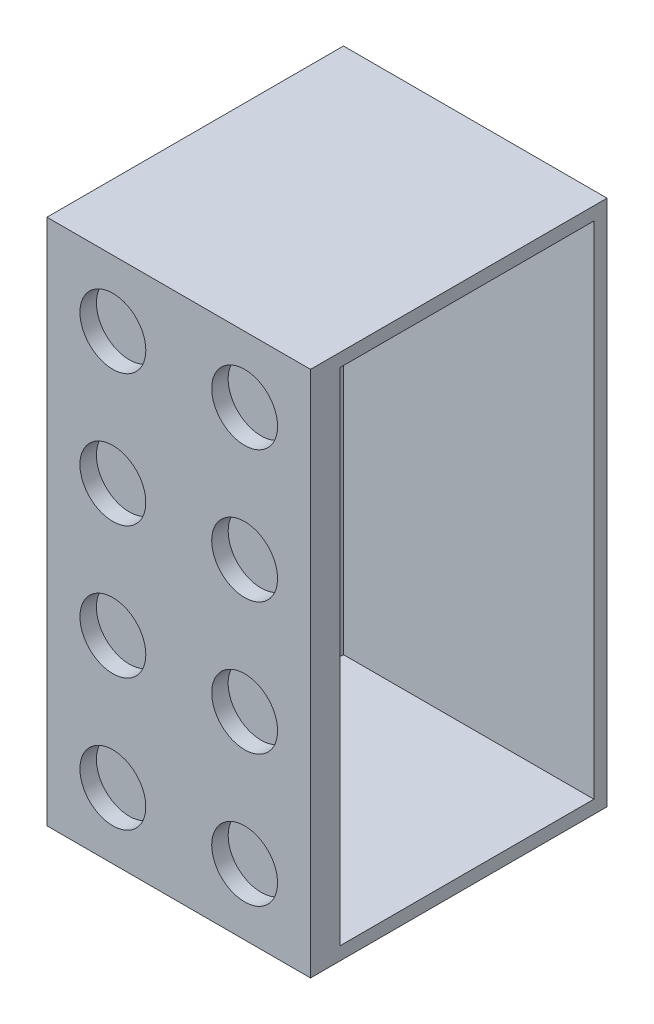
from build123d import *

# Parameters (mm, degrees)
SKETCH1_W           = 50.8
SKETCH1_H           = 101.6
BOSS_EXTRUDE1_DEPTH = 57.15
SKETCH3_R           = 6.35
SKETCH3_R_2         = 2.54
CUT_EXTRUDE2_DEPTH  = 3.175
SKETCH6_W           = 48.895
SKETCH6_H           = 96.52
CUT_EXTRUDE5_DEPTH  = 48.26


with BuildPart() as part:
    # Sketch1 → Boss-Extrude1 (new body)
    with BuildSketch(Plane.XY):
        with Locations((25.4, 50.8)):
            Rectangle(SKETCH1_W, SKETCH1_H)
    extrude(amount=BOSS_EXTRUDE1_DEPTH)

    # Sketch3 → Cut-Extrude2 (cut)
    with BuildSketch(Plane.XY.offset(57.15)):
        with Locations((12.7, 139.7)):
            Circle(SKETCH3_R)
        with Locations((38.1, 139.7)):
            Circle(SKETCH3_R)
        with Locations((63.5, 139.7)):
            Circle(SKETCH3_R_2)
        with Locations((88.9, 139.7)):
            Circle(SKETCH3_R_2)
        with Locations((88.9, 114.3)):
            Circle(SKETCH3_R_2)
        with Locations((63.5, 114.3)):
            Circle(SKETCH3_R_2)
        with Locations((38.1, 114.3)):
            Circle(SKETCH3_R)
        with Locations((12.7, 114.3)):
            Circle(SKETCH3_R)
        with Locations((88.9, 88.9)):
            Circle(SKETCH3_R_2)
        with Locations((63.5, 88.9)):
            Circle(SKETCH3_R_2)
        with Locations((38.1, 88.9)):
            Circle(SKETCH3_R)
        with Locations((12.7, 88.9)):
            Circle(SKETCH3_R)
        with Locations((88.9, 63.5)):
            Circle(SKETCH3_R_2)
        with Locations((63.5, 63.5)):
            Circle(SKETCH3_R_2)
        with Locations(Location((38.1, 63.5, 0), (0, 0, 180))):
            Circle(SKETCH3_R)
        with Locations(Location((12.7, 63.5, 0), (0, 0, 180))):
            Circle(SKETCH3_R)
        with Locations((88.9, 38.1)):
            Circle(SKETCH3_R_2)
        with Locations((63.5, 38.1)):
            Circle(SKETCH3_R_2)
        with Locations((38.1, 38.1)):
            Circle(SKETCH3_R)
        with Locations((12.7, 38.1)):
            Circle(SKETCH3_R)
        with Locations((88.9, 12.7)):
            Circle(SKETCH3_R_2)
        with Locations((63.5, 12.7)):
            Circle(SKETCH3_R_2)
        with Locations(Location((38.1, 12.7, 0), (0, 0, 180))):
            Circle(SKETCH3_R)
        with Locations(Location((12.7, 12.7, 0), (0, 0, 180))):
            Circle(SKETCH3_R)
    extrude(amount=-CUT_EXTRUDE2_DEPTH, mode=Mode.SUBTRACT)

    # Sketch6 → Cut-Extrude5 (cut)
    with BuildSketch(Plane(origin=(50.8, 0, 0), x_dir=(0, 0, -1), z_dir=(1, 0, 0))):
        with Locations((-26.9875, 50.8)):
            Rectangle(SKETCH6_W, SKETCH6_H)
    extrude(amount=-CUT_EXTRUDE5_DEPTH, mode=Mode.SUBTRACT)


solid = part.part
